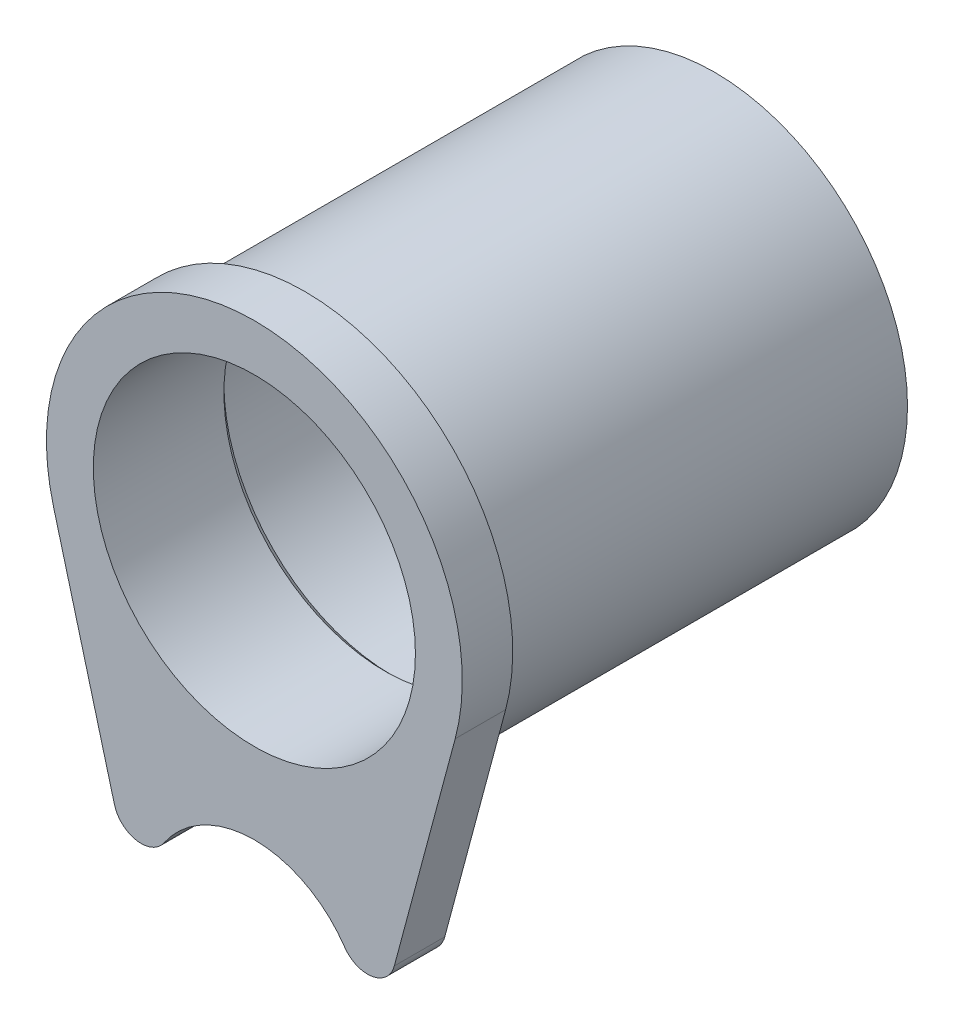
from build123d import *

# Parameters (mm, degrees)
SKETCH1_R           = 8.8392
BOSS_EXTRUDE1_DEPTH = 21.082
SKETCH2_R           = 7.747
CUT_EXTRUDE1_DEPTH  = 14.732
SKETCH3_R           = 7.3787
CUT_EXTRUDE2_DEPTH  = 14.732
BOSS_EXTRUDE2_START = -2.3114
SKETCH4_R           = 7.3787
BOSS_EXTRUDE2_DEPTH = 2.3114
FILLET1_R           = 0.381
BOSS_EXTRUDE3_START = 2.921
BOSS_EXTRUDE3_DEPTH = 2.8448


with BuildPart() as part:
    # Sketch1 → Boss-Extrude1 (new body)
    with BuildSketch(Plane.XY):
        Circle(SKETCH1_R)
    extrude(amount=-BOSS_EXTRUDE1_DEPTH)

    # Sketch2 → Cut-Extrude1 (cut)
    with BuildSketch(Plane(origin=(0, 0, -21.082), x_dir=(-1, 0, 0), z_dir=(0, 0, -1))):
        Circle(SKETCH2_R)
    extrude(amount=-CUT_EXTRUDE1_DEPTH, mode=Mode.SUBTRACT)

    # Sketch3 → Cut-Extrude2 (cut)
    with BuildSketch(Plane(origin=(0, 0, -6.35), x_dir=(-1, 0, 0), z_dir=(0, 0, -1))):
        Circle(SKETCH3_R)
    extrude(amount=-CUT_EXTRUDE2_DEPTH, mode=Mode.SUBTRACT)

    # Sketch4 → Boss-Extrude2 (add)
    with BuildSketch(Plane.XY.offset(BOSS_EXTRUDE2_START)):
        with BuildLine():
            Line((-9.200443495, -2.465251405), (-6.411374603, -12.874198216))
            ThreePointArc((-6.411374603, -12.874198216), (-5.397205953, -13.797584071), (-4.135124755, -13.260619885))
            ThreePointArc((-4.135124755, -13.260619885), (0, -11.0744), (4.135124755, -13.260619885))
            ThreePointArc((4.135124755, -13.260619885), (5.397205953, -13.797584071), (6.411374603, -12.874198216))
            Line((6.411374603, -12.874198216), (9.200443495, -2.465251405))
            ThreePointArc((9.200443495, -2.465251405), (0, 9.525), (-9.200443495, -2.465251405))
        make_face()
        with Locations(Location((0, 0, 0), (0, 0, 180))):
            Circle(SKETCH4_R, mode=Mode.SUBTRACT)
    extrude(amount=BOSS_EXTRUDE2_DEPTH)

    # Sketch5 → Cut-Revolve1 (revolve, cut)
    with BuildSketch(Plane(origin=(0, 0, 0), x_dir=(0, 0, -1), z_dir=(1, 0, 0)), mode=Mode.PRIVATE) as cut_revolve1_sk:
        Polygon((6.35, -7.747), (6.35, -7.3787), (5.9817, -7.3787), align=None)
    revolve(cut_revolve1_sk.sketch.rotate(Axis((0, 0, 0), (0, 0, -1)), 270), axis=Axis((0, 0, 0), (0, 0, -1)), mode=Mode.SUBTRACT)

    # Fillet1
    fillet1_edges = [part.edges().sort_by_distance(p)[0] for p in [
        (-8.8392, 0, -2.3114),
    ]]
    fillet(fillet1_edges, radius=FILLET1_R)

    # Sketch6 → Boss-Extrude3 (add)
    with BuildSketch(Plane(origin=(0, 0, -2.3114), x_dir=(-1, 0, 0), z_dir=(0, 0, -1)).offset(BOSS_EXTRUDE3_START)):
        with BuildLine():
            Line((8.554859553, -4.874603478), (8.363941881, -5.587117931))
            ThreePointArc((8.363941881, -5.587117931), (6.675393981, -7.523996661), (4.551193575, -8.969841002))
            ThreePointArc((4.551193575, -8.969841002), (3.060514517, -8.638564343), (1.534910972, -8.70491269))
            ThreePointArc((1.534910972, -8.70491269), (6.028319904, -6.464581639), (8.576637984, -2.13839602))
            ThreePointArc((8.576637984, -2.13839602), (8.403290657, -3.505206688), (8.554859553, -4.874603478))
        make_face()
    extrude(amount=BOSS_EXTRUDE3_DEPTH)


solid = part.part
